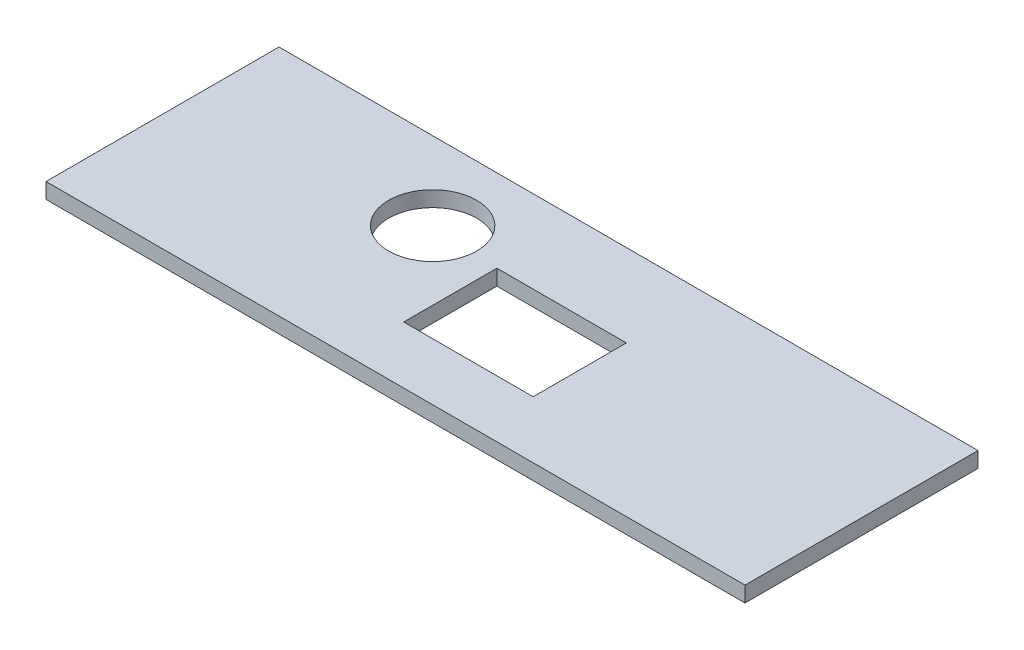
ISO-10303-21;
HEADER;
FILE_DESCRIPTION(('STEP AP214'),'2;1');
FILE_NAME('part.step','',(''),(''),'','','');
FILE_SCHEMA(('AUTOMOTIVE_DESIGN { 1 0 10303 214 1 1 1 1 }'));
ENDSEC;
DATA;
#1=APPLICATION_CONTEXT('core data for automotive mechanical design processes');
#2=APPLICATION_PROTOCOL_DEFINITION('international standard','automotive_design',2000,#1);
#3=PRODUCT_CONTEXT('',#1,'mechanical');
#4=PRODUCT('Part','Part','',(#3));
#5=PRODUCT_RELATED_PRODUCT_CATEGORY('part','',(#4));
#6=PRODUCT_DEFINITION_FORMATION('','',#4);
#7=PRODUCT_DEFINITION_CONTEXT('part definition',#1,'design');
#8=PRODUCT_DEFINITION('design','',#6,#7);
#9=PRODUCT_DEFINITION_SHAPE('','',#8);
#10=(LENGTH_UNIT() NAMED_UNIT(*) SI_UNIT(.MILLI.,.METRE.));
#11=(NAMED_UNIT(*) PLANE_ANGLE_UNIT() SI_UNIT($,.RADIAN.));
#12=(NAMED_UNIT(*) SI_UNIT($,.STERADIAN.) SOLID_ANGLE_UNIT());
#13=UNCERTAINTY_MEASURE_WITH_UNIT(LENGTH_MEASURE(1.E-05),#10,'distance_accuracy_value','');
#14=(GEOMETRIC_REPRESENTATION_CONTEXT(3) GLOBAL_UNCERTAINTY_ASSIGNED_CONTEXT((#13)) GLOBAL_UNIT_ASSIGNED_CONTEXT((#10,
#11,#12)) REPRESENTATION_CONTEXT('',''));
#15=CARTESIAN_POINT('',(0.,0.,0.));
#16=DIRECTION('',(0.,0.,1.));
#17=DIRECTION('',(1.,0.,0.));
#18=AXIS2_PLACEMENT_3D('',#15,#16,#17);
#19=CARTESIAN_POINT('',(67.5,3.,22.5));
#20=DIRECTION('',(-1.,0.,0.));
#21=DIRECTION('',(0.,0.,1.));
#22=AXIS2_PLACEMENT_3D('',#19,#20,#21);
#23=PLANE('',#22);
#24=DIRECTION('',(0.,0.,-1.));
#25=VECTOR('',#24,1.);
#26=CARTESIAN_POINT('',(67.5,0.,22.5));
#27=LINE('',#26,#25);
#28=CARTESIAN_POINT('',(67.5,0.,22.5));
#29=VERTEX_POINT('',#28);
#30=CARTESIAN_POINT('',(67.5,0.,-22.5));
#31=VERTEX_POINT('',#30);
#32=EDGE_CURVE('E112',#29,#31,#27,.T.);
#33=ORIENTED_EDGE('',*,*,#32,.T.);
#34=DIRECTION('',(0.,-1.,0.));
#35=VECTOR('',#34,1.);
#36=CARTESIAN_POINT('',(67.5,3.,-22.5));
#37=LINE('',#36,#35);
#38=CARTESIAN_POINT('',(67.5,3.,-22.5));
#39=VERTEX_POINT('',#38);
#40=EDGE_CURVE('E11',#39,#31,#37,.T.);
#41=ORIENTED_EDGE('',*,*,#40,.F.);
#42=DIRECTION('',(0.,0.,-1.));
#43=VECTOR('',#42,1.);
#44=CARTESIAN_POINT('',(67.5,3.,22.5));
#45=LINE('',#44,#43);
#46=CARTESIAN_POINT('',(67.5,3.,22.5));
#47=VERTEX_POINT('',#46);
#48=EDGE_CURVE('E135',#47,#39,#45,.T.);
#49=ORIENTED_EDGE('',*,*,#48,.F.);
#50=DIRECTION('',(0.,-1.,0.));
#51=VECTOR('',#50,1.);
#52=CARTESIAN_POINT('',(67.5,3.,22.5));
#53=LINE('',#52,#51);
#54=EDGE_CURVE('E145',#47,#29,#53,.T.);
#55=ORIENTED_EDGE('',*,*,#54,.T.);
#56=EDGE_LOOP('',(#33,#41,#49,#55));
#57=FACE_BOUND('',#56,.T.);
#58=ADVANCED_FACE('F34',(#57),#23,.F.);
#59=CARTESIAN_POINT('',(-67.5,3.,-22.5));
#60=DIRECTION('',(0.,0.,1.));
#61=DIRECTION('',(1.,0.,0.));
#62=AXIS2_PLACEMENT_3D('',#59,#60,#61);
#63=PLANE('',#62);
#64=DIRECTION('',(-1.,0.,0.));
#65=VECTOR('',#64,1.);
#66=CARTESIAN_POINT('',(-67.5,0.,-22.5));
#67=LINE('',#66,#65);
#68=CARTESIAN_POINT('',(-67.5,0.,-22.5));
#69=VERTEX_POINT('',#68);
#70=EDGE_CURVE('E148',#31,#69,#67,.T.);
#71=ORIENTED_EDGE('',*,*,#70,.T.);
#72=DIRECTION('',(0.,-1.,0.));
#73=VECTOR('',#72,1.);
#74=CARTESIAN_POINT('',(-67.5,3.,-22.5));
#75=LINE('',#74,#73);
#76=CARTESIAN_POINT('',(-67.5,3.,-22.5));
#77=VERTEX_POINT('',#76);
#78=EDGE_CURVE('E41',#77,#69,#75,.T.);
#79=ORIENTED_EDGE('',*,*,#78,.F.);
#80=DIRECTION('',(-1.,0.,0.));
#81=VECTOR('',#80,1.);
#82=CARTESIAN_POINT('',(-67.5,3.,-22.5));
#83=LINE('',#82,#81);
#84=EDGE_CURVE('E138',#39,#77,#83,.T.);
#85=ORIENTED_EDGE('',*,*,#84,.F.);
#86=ORIENTED_EDGE('',*,*,#40,.T.);
#87=EDGE_LOOP('',(#71,#79,#85,#86));
#88=FACE_BOUND('',#87,.T.);
#89=ADVANCED_FACE('F176',(#88),#63,.F.);
#90=CARTESIAN_POINT('',(-67.5,3.,22.5));
#91=DIRECTION('',(1.,0.,0.));
#92=DIRECTION('',(0.,0.,-1.));
#93=AXIS2_PLACEMENT_3D('',#90,#91,#92);
#94=PLANE('',#93);
#95=DIRECTION('',(0.,0.,1.));
#96=VECTOR('',#95,1.);
#97=CARTESIAN_POINT('',(-67.5,0.,22.5));
#98=LINE('',#97,#96);
#99=CARTESIAN_POINT('',(-67.5,0.,22.5));
#100=VERTEX_POINT('',#99);
#101=EDGE_CURVE('E150',#69,#100,#98,.T.);
#102=ORIENTED_EDGE('',*,*,#101,.T.);
#103=DIRECTION('',(0.,-1.,0.));
#104=VECTOR('',#103,1.);
#105=CARTESIAN_POINT('',(-67.5,3.,22.5));
#106=LINE('',#105,#104);
#107=CARTESIAN_POINT('',(-67.5,3.,22.5));
#108=VERTEX_POINT('',#107);
#109=EDGE_CURVE('E155',#108,#100,#106,.T.);
#110=ORIENTED_EDGE('',*,*,#109,.F.);
#111=DIRECTION('',(0.,0.,1.));
#112=VECTOR('',#111,1.);
#113=CARTESIAN_POINT('',(-67.5,3.,22.5));
#114=LINE('',#113,#112);
#115=EDGE_CURVE('E141',#77,#108,#114,.T.);
#116=ORIENTED_EDGE('',*,*,#115,.F.);
#117=ORIENTED_EDGE('',*,*,#78,.T.);
#118=EDGE_LOOP('',(#102,#110,#116,#117));
#119=FACE_BOUND('',#118,.T.);
#120=ADVANCED_FACE('F162',(#119),#94,.F.);
#121=CARTESIAN_POINT('',(-67.5,3.,22.5));
#122=DIRECTION('',(0.,0.,-1.));
#123=DIRECTION('',(-1.,0.,0.));
#124=AXIS2_PLACEMENT_3D('',#121,#122,#123);
#125=PLANE('',#124);
#126=DIRECTION('',(1.,0.,0.));
#127=VECTOR('',#126,1.);
#128=CARTESIAN_POINT('',(-67.5,0.,22.5));
#129=LINE('',#128,#127);
#130=EDGE_CURVE('E139',#100,#29,#129,.T.);
#131=ORIENTED_EDGE('',*,*,#130,.T.);
#132=ORIENTED_EDGE('',*,*,#54,.F.);
#133=DIRECTION('',(1.,0.,0.));
#134=VECTOR('',#133,1.);
#135=CARTESIAN_POINT('',(-67.5,3.,22.5));
#136=LINE('',#135,#134);
#137=EDGE_CURVE('E143',#108,#47,#136,.T.);
#138=ORIENTED_EDGE('',*,*,#137,.F.);
#139=ORIENTED_EDGE('',*,*,#109,.T.);
#140=EDGE_LOOP('',(#131,#132,#138,#139));
#141=FACE_BOUND('',#140,.T.);
#142=ADVANCED_FACE('F171',(#141),#125,.F.);
#143=CARTESIAN_POINT('',(0.,3.,0.));
#144=DIRECTION('',(0.,-1.,0.));
#145=DIRECTION('',(0.,0.,-1.));
#146=AXIS2_PLACEMENT_3D('',#143,#144,#145);
#147=PLANE('',#146);
#148=CARTESIAN_POINT('',(-22.7794225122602,3.,-7.4534041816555));
#149=DIRECTION('',(0.,-1.,0.));
#150=DIRECTION('',(0.,0.,-1.));
#151=AXIS2_PLACEMENT_3D('',#148,#149,#150);
#152=CIRCLE('',#151,8.5);
#153=CARTESIAN_POINT('',(-22.7794225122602,3.,-15.9534041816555));
#154=VERTEX_POINT('',#153);
#155=EDGE_CURVE('E214',#154,#154,#152,.F.);
#156=ORIENTED_EDGE('',*,*,#155,.F.);
#157=EDGE_LOOP('',(#156));
#158=FACE_BOUND('',#157,.T.);
#159=DIRECTION('',(-1.,0.,0.));
#160=VECTOR('',#159,1.);
#161=CARTESIAN_POINT('',(-9.45836943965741,3.,-6.54163056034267));
#162=LINE('',#161,#160);
#163=CARTESIAN_POINT('',(15.5416305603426,3.,-6.54163056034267));
#164=VERTEX_POINT('',#163);
#165=CARTESIAN_POINT('',(-9.45836943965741,3.,-6.54163056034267));
#166=VERTEX_POINT('',#165);
#167=EDGE_CURVE('E118',#164,#166,#162,.T.);
#168=ORIENTED_EDGE('',*,*,#167,.F.);
#169=DIRECTION('',(0.,0.,-1.));
#170=VECTOR('',#169,1.);
#171=CARTESIAN_POINT('',(15.5416305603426,3.,11.4583694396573));
#172=LINE('',#171,#170);
#173=CARTESIAN_POINT('',(15.5416305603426,3.,11.4583694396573));
#174=VERTEX_POINT('',#173);
#175=EDGE_CURVE('E100',#174,#164,#172,.T.);
#176=ORIENTED_EDGE('',*,*,#175,.F.);
#177=DIRECTION('',(1.,0.,0.));
#178=VECTOR('',#177,1.);
#179=CARTESIAN_POINT('',(-9.45836943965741,3.,11.4583694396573));
#180=LINE('',#179,#178);
#181=CARTESIAN_POINT('',(-9.45836943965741,3.,11.4583694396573));
#182=VERTEX_POINT('',#181);
#183=EDGE_CURVE('E109',#182,#174,#180,.T.);
#184=ORIENTED_EDGE('',*,*,#183,.F.);
#185=DIRECTION('',(0.,0.,1.));
#186=VECTOR('',#185,1.);
#187=CARTESIAN_POINT('',(-9.45836943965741,3.,11.4583694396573));
#188=LINE('',#187,#186);
#189=EDGE_CURVE('E48',#166,#182,#188,.T.);
#190=ORIENTED_EDGE('',*,*,#189,.F.);
#191=EDGE_LOOP('',(#168,#176,#184,#190));
#192=FACE_BOUND('',#191,.T.);
#193=ORIENTED_EDGE('',*,*,#48,.T.);
#194=ORIENTED_EDGE('',*,*,#84,.T.);
#195=ORIENTED_EDGE('',*,*,#115,.T.);
#196=ORIENTED_EDGE('',*,*,#137,.T.);
#197=EDGE_LOOP('',(#193,#194,#195,#196));
#198=FACE_BOUND('',#197,.T.);
#199=ADVANCED_FACE('F115',(#158,#192,#198),#147,.F.);
#200=CARTESIAN_POINT('',(0.,0.,0.));
#201=DIRECTION('',(0.,-1.,0.));
#202=DIRECTION('',(0.,0.,-1.));
#203=AXIS2_PLACEMENT_3D('',#200,#201,#202);
#204=PLANE('',#203);
#205=CARTESIAN_POINT('',(-22.7794225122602,0.,-7.4534041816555));
#206=DIRECTION('',(0.,-1.,0.));
#207=DIRECTION('',(0.,0.,-1.));
#208=AXIS2_PLACEMENT_3D('',#205,#206,#207);
#209=CIRCLE('',#208,8.5);
#210=CARTESIAN_POINT('',(-22.7794225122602,0.,-15.9534041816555));
#211=VERTEX_POINT('',#210);
#212=EDGE_CURVE('E211',#211,#211,#209,.T.);
#213=ORIENTED_EDGE('',*,*,#212,.F.);
#214=EDGE_LOOP('',(#213));
#215=FACE_BOUND('',#214,.T.);
#216=DIRECTION('',(0.,0.,1.));
#217=VECTOR('',#216,1.);
#218=CARTESIAN_POINT('',(15.5416305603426,0.,11.4583694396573));
#219=LINE('',#218,#217);
#220=CARTESIAN_POINT('',(15.5416305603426,0.,-6.54163056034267));
#221=VERTEX_POINT('',#220);
#222=CARTESIAN_POINT('',(15.5416305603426,0.,11.4583694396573));
#223=VERTEX_POINT('',#222);
#224=EDGE_CURVE('E56',#221,#223,#219,.T.);
#225=ORIENTED_EDGE('',*,*,#224,.F.);
#226=DIRECTION('',(1.,0.,0.));
#227=VECTOR('',#226,1.);
#228=CARTESIAN_POINT('',(-9.45836943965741,0.,-6.54163056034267));
#229=LINE('',#228,#227);
#230=CARTESIAN_POINT('',(-9.45836943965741,0.,-6.54163056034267));
#231=VERTEX_POINT('',#230);
#232=EDGE_CURVE('E106',#231,#221,#229,.T.);
#233=ORIENTED_EDGE('',*,*,#232,.F.);
#234=DIRECTION('',(0.,0.,-1.));
#235=VECTOR('',#234,1.);
#236=CARTESIAN_POINT('',(-9.45836943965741,0.,11.4583694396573));
#237=LINE('',#236,#235);
#238=CARTESIAN_POINT('',(-9.45836943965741,0.,11.4583694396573));
#239=VERTEX_POINT('',#238);
#240=EDGE_CURVE('E126',#239,#231,#237,.T.);
#241=ORIENTED_EDGE('',*,*,#240,.F.);
#242=DIRECTION('',(-1.,0.,0.));
#243=VECTOR('',#242,1.);
#244=CARTESIAN_POINT('',(-9.45836943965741,0.,11.4583694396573));
#245=LINE('',#244,#243);
#246=EDGE_CURVE('E120',#223,#239,#245,.T.);
#247=ORIENTED_EDGE('',*,*,#246,.F.);
#248=EDGE_LOOP('',(#225,#233,#241,#247));
#249=FACE_BOUND('',#248,.T.);
#250=ORIENTED_EDGE('',*,*,#32,.F.);
#251=ORIENTED_EDGE('',*,*,#130,.F.);
#252=ORIENTED_EDGE('',*,*,#101,.F.);
#253=ORIENTED_EDGE('',*,*,#70,.F.);
#254=EDGE_LOOP('',(#250,#251,#252,#253));
#255=FACE_BOUND('',#254,.T.);
#256=ADVANCED_FACE('F168',(#215,#249,#255),#204,.T.);
#257=CARTESIAN_POINT('',(15.5416305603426,3.001,11.4583694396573));
#258=DIRECTION('',(1.,0.,0.));
#259=DIRECTION('',(0.,0.,-1.));
#260=AXIS2_PLACEMENT_3D('',#257,#258,#259);
#261=PLANE('',#260);
#262=ORIENTED_EDGE('',*,*,#175,.T.);
#263=DIRECTION('',(0.,-1.,0.));
#264=VECTOR('',#263,1.);
#265=CARTESIAN_POINT('',(15.5416305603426,3.001,-6.54163056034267));
#266=LINE('',#265,#264);
#267=EDGE_CURVE('E113',#164,#221,#266,.T.);
#268=ORIENTED_EDGE('',*,*,#267,.T.);
#269=ORIENTED_EDGE('',*,*,#224,.T.);
#270=DIRECTION('',(0.,-1.,0.));
#271=VECTOR('',#270,1.);
#272=CARTESIAN_POINT('',(15.5416305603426,3.001,11.4583694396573));
#273=LINE('',#272,#271);
#274=EDGE_CURVE('E96',#174,#223,#273,.T.);
#275=ORIENTED_EDGE('',*,*,#274,.F.);
#276=EDGE_LOOP('',(#262,#268,#269,#275));
#277=FACE_BOUND('',#276,.T.);
#278=ADVANCED_FACE('F98',(#277),#261,.F.);
#279=CARTESIAN_POINT('',(-9.45836943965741,3.001,-6.54163056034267));
#280=DIRECTION('',(0.,0.,-1.));
#281=DIRECTION('',(-1.,0.,0.));
#282=AXIS2_PLACEMENT_3D('',#279,#280,#281);
#283=PLANE('',#282);
#284=ORIENTED_EDGE('',*,*,#167,.T.);
#285=DIRECTION('',(0.,-1.,0.));
#286=VECTOR('',#285,1.);
#287=CARTESIAN_POINT('',(-9.45836943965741,3.001,-6.54163056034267));
#288=LINE('',#287,#286);
#289=EDGE_CURVE('E132',#166,#231,#288,.T.);
#290=ORIENTED_EDGE('',*,*,#289,.T.);
#291=ORIENTED_EDGE('',*,*,#232,.T.);
#292=ORIENTED_EDGE('',*,*,#267,.F.);
#293=EDGE_LOOP('',(#284,#290,#291,#292));
#294=FACE_BOUND('',#293,.T.);
#295=ADVANCED_FACE('F194',(#294),#283,.F.);
#296=CARTESIAN_POINT('',(-9.45836943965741,3.001,11.4583694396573));
#297=DIRECTION('',(-1.,0.,0.));
#298=DIRECTION('',(0.,0.,1.));
#299=AXIS2_PLACEMENT_3D('',#296,#297,#298);
#300=PLANE('',#299);
#301=ORIENTED_EDGE('',*,*,#189,.T.);
#302=DIRECTION('',(0.,-1.,0.));
#303=VECTOR('',#302,1.);
#304=CARTESIAN_POINT('',(-9.45836943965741,3.001,11.4583694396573));
#305=LINE('',#304,#303);
#306=EDGE_CURVE('E105',#182,#239,#305,.T.);
#307=ORIENTED_EDGE('',*,*,#306,.T.);
#308=ORIENTED_EDGE('',*,*,#240,.T.);
#309=ORIENTED_EDGE('',*,*,#289,.F.);
#310=EDGE_LOOP('',(#301,#307,#308,#309));
#311=FACE_BOUND('',#310,.T.);
#312=ADVANCED_FACE('F198',(#311),#300,.F.);
#313=CARTESIAN_POINT('',(-9.45836943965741,3.001,11.4583694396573));
#314=DIRECTION('',(0.,0.,1.));
#315=DIRECTION('',(1.,0.,0.));
#316=AXIS2_PLACEMENT_3D('',#313,#314,#315);
#317=PLANE('',#316);
#318=ORIENTED_EDGE('',*,*,#183,.T.);
#319=ORIENTED_EDGE('',*,*,#274,.T.);
#320=ORIENTED_EDGE('',*,*,#246,.T.);
#321=ORIENTED_EDGE('',*,*,#306,.F.);
#322=EDGE_LOOP('',(#318,#319,#320,#321));
#323=FACE_BOUND('',#322,.T.);
#324=ADVANCED_FACE('F110',(#323),#317,.F.);
#325=CARTESIAN_POINT('',(-22.7794225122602,3.001,-7.4534041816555));
#326=DIRECTION('',(0.,-1.,0.));
#327=DIRECTION('',(0.,0.,-1.));
#328=AXIS2_PLACEMENT_3D('',#325,#326,#327);
#329=CYLINDRICAL_SURFACE('',#328,8.5);
#330=CARTESIAN_POINT('',(-22.7794225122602,0.,-15.9534041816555));
#331=CARTESIAN_POINT('',(-22.7794225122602,0.0312500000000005,-15.9534041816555));
#332=CARTESIAN_POINT('',(-22.7794225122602,0.0625000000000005,-15.9534041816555));
#333=CARTESIAN_POINT('',(-22.7794225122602,0.125000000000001,-15.9534041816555));
#334=CARTESIAN_POINT('',(-22.7794225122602,0.156250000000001,-15.9534041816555));
#335=CARTESIAN_POINT('',(-22.7794225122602,0.218750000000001,-15.9534041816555));
#336=CARTESIAN_POINT('',(-22.7794225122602,0.250000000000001,-15.9534041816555));
#337=CARTESIAN_POINT('',(-22.7794225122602,0.312500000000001,-15.9534041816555));
#338=CARTESIAN_POINT('',(-22.7794225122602,0.34375,-15.9534041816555));
#339=CARTESIAN_POINT('',(-22.7794225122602,0.40625,-15.9534041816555));
#340=CARTESIAN_POINT('',(-22.7794225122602,0.4375,-15.9534041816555));
#341=CARTESIAN_POINT('',(-22.7794225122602,0.5,-15.9534041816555));
#342=CARTESIAN_POINT('',(-22.7794225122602,0.53125,-15.9534041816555));
#343=CARTESIAN_POINT('',(-22.7794225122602,0.593750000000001,-15.9534041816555));
#344=CARTESIAN_POINT('',(-22.7794225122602,0.625000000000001,-15.9534041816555));
#345=CARTESIAN_POINT('',(-22.7794225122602,0.687500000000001,-15.9534041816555));
#346=CARTESIAN_POINT('',(-22.7794225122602,0.71875,-15.9534041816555));
#347=CARTESIAN_POINT('',(-22.7794225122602,0.78125,-15.9534041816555));
#348=CARTESIAN_POINT('',(-22.7794225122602,0.8125,-15.9534041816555));
#349=CARTESIAN_POINT('',(-22.7794225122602,0.875,-15.9534041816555));
#350=CARTESIAN_POINT('',(-22.7794225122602,0.90625,-15.9534041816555));
#351=CARTESIAN_POINT('',(-22.7794225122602,0.96875,-15.9534041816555));
#352=CARTESIAN_POINT('',(-22.7794225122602,1.,-15.9534041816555));
#353=CARTESIAN_POINT('',(-22.7794225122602,1.0625,-15.9534041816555));
#354=CARTESIAN_POINT('',(-22.7794225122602,1.09375,-15.9534041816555));
#355=CARTESIAN_POINT('',(-22.7794225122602,1.15625,-15.9534041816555));
#356=CARTESIAN_POINT('',(-22.7794225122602,1.1875,-15.9534041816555));
#357=CARTESIAN_POINT('',(-22.7794225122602,1.25,-15.9534041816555));
#358=CARTESIAN_POINT('',(-22.7794225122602,1.28125,-15.9534041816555));
#359=CARTESIAN_POINT('',(-22.7794225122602,1.34375,-15.9534041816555));
#360=CARTESIAN_POINT('',(-22.7794225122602,1.375,-15.9534041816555));
#361=CARTESIAN_POINT('',(-22.7794225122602,1.4375,-15.9534041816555));
#362=CARTESIAN_POINT('',(-22.7794225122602,1.46875,-15.9534041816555));
#363=CARTESIAN_POINT('',(-22.7794225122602,1.53125,-15.9534041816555));
#364=CARTESIAN_POINT('',(-22.7794225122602,1.5625,-15.9534041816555));
#365=CARTESIAN_POINT('',(-22.7794225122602,1.625,-15.9534041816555));
#366=CARTESIAN_POINT('',(-22.7794225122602,1.65625,-15.9534041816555));
#367=CARTESIAN_POINT('',(-22.7794225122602,1.71875,-15.9534041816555));
#368=CARTESIAN_POINT('',(-22.7794225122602,1.75,-15.9534041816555));
#369=CARTESIAN_POINT('',(-22.7794225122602,1.8125,-15.9534041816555));
#370=CARTESIAN_POINT('',(-22.7794225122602,1.84375,-15.9534041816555));
#371=CARTESIAN_POINT('',(-22.7794225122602,1.90625,-15.9534041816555));
#372=CARTESIAN_POINT('',(-22.7794225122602,1.9375,-15.9534041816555));
#373=CARTESIAN_POINT('',(-22.7794225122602,2.,-15.9534041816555));
#374=CARTESIAN_POINT('',(-22.7794225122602,2.03125,-15.9534041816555));
#375=CARTESIAN_POINT('',(-22.7794225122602,2.09375,-15.9534041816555));
#376=CARTESIAN_POINT('',(-22.7794225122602,2.125,-15.9534041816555));
#377=CARTESIAN_POINT('',(-22.7794225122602,2.1875,-15.9534041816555));
#378=CARTESIAN_POINT('',(-22.7794225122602,2.21875,-15.9534041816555));
#379=CARTESIAN_POINT('',(-22.7794225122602,2.28125,-15.9534041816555));
#380=CARTESIAN_POINT('',(-22.7794225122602,2.3125,-15.9534041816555));
#381=CARTESIAN_POINT('',(-22.7794225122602,2.375,-15.9534041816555));
#382=CARTESIAN_POINT('',(-22.7794225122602,2.40625,-15.9534041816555));
#383=CARTESIAN_POINT('',(-22.7794225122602,2.46875,-15.9534041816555));
#384=CARTESIAN_POINT('',(-22.7794225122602,2.5,-15.9534041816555));
#385=CARTESIAN_POINT('',(-22.7794225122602,2.5625,-15.9534041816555));
#386=CARTESIAN_POINT('',(-22.7794225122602,2.59375,-15.9534041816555));
#387=CARTESIAN_POINT('',(-22.7794225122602,2.65625,-15.9534041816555));
#388=CARTESIAN_POINT('',(-22.7794225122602,2.6875,-15.9534041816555));
#389=CARTESIAN_POINT('',(-22.7794225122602,2.75,-15.9534041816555));
#390=CARTESIAN_POINT('',(-22.7794225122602,2.78125,-15.9534041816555));
#391=CARTESIAN_POINT('',(-22.7794225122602,2.84375,-15.9534041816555));
#392=CARTESIAN_POINT('',(-22.7794225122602,2.875,-15.9534041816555));
#393=CARTESIAN_POINT('',(-22.7794225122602,2.9375,-15.9534041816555));
#394=CARTESIAN_POINT('',(-22.7794225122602,2.96875,-15.9534041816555));
#395=CARTESIAN_POINT('',(-22.7794225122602,3.,-15.9534041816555));
#396=B_SPLINE_CURVE_WITH_KNOTS('',3,(#330,#331,#332,#333,#334,#335,#336,#337,#338,#339,#340,
#341,#342,#343,#344,#345,#346,#347,#348,#349,#350,#351,#352,#353,#354,#355,#356,#357,#358,#359,
#360,#361,#362,#363,#364,#365,#366,#367,#368,#369,#370,#371,#372,#373,#374,#375,#376,#377,#378,
#379,#380,#381,#382,#383,#384,#385,#386,#387,#388,#389,#390,#391,#392,#393,#394,#395),
.UNSPECIFIED.,.F.,.F.,(4,2,2,2,2,2,2,2,2,2,2,2,2,2,2,2,2,2,2,2,2,2,2,2,2,2,2,2,2,2,2,2,4),(0.,
0.0937500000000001,0.1875,0.28125,0.375,0.46875,0.5625,0.65625,0.75,0.84375,0.9375,1.03125,
1.125,1.21875,1.3125,1.40625,1.5,1.59375,1.6875,1.78125,1.875,1.96875,2.0625,2.15625,2.25,
2.34375,2.4375,2.53125,2.625,2.71875,2.8125,2.90625,3.),.UNSPECIFIED.);
#397=EDGE_CURVE('BSEAM197',#211,#154,#396,.T.);
#398=ORIENTED_EDGE('',*,*,#212,.T.);
#399=ORIENTED_EDGE('',*,*,#155,.T.);
#400=ORIENTED_EDGE('',*,*,#397,.T.);
#401=ORIENTED_EDGE('',*,*,#397,.F.);
#402=EDGE_LOOP('',(#398,#400,#399,#401));
#403=FACE_BOUND('',#402,.T.);
#404=ADVANCED_FACE('F197',(#403),#329,.F.);
#405=CLOSED_SHELL('',(#58,#89,#120,#142,#199,#256,#278,#295,#312,#324,#404));
#406=MANIFOLD_SOLID_BREP('B2',#405);
#407=ADVANCED_BREP_SHAPE_REPRESENTATION('',(#18,#406),#14);
#408=SHAPE_DEFINITION_REPRESENTATION(#9,#407);
ENDSEC;
END-ISO-10303-21;
